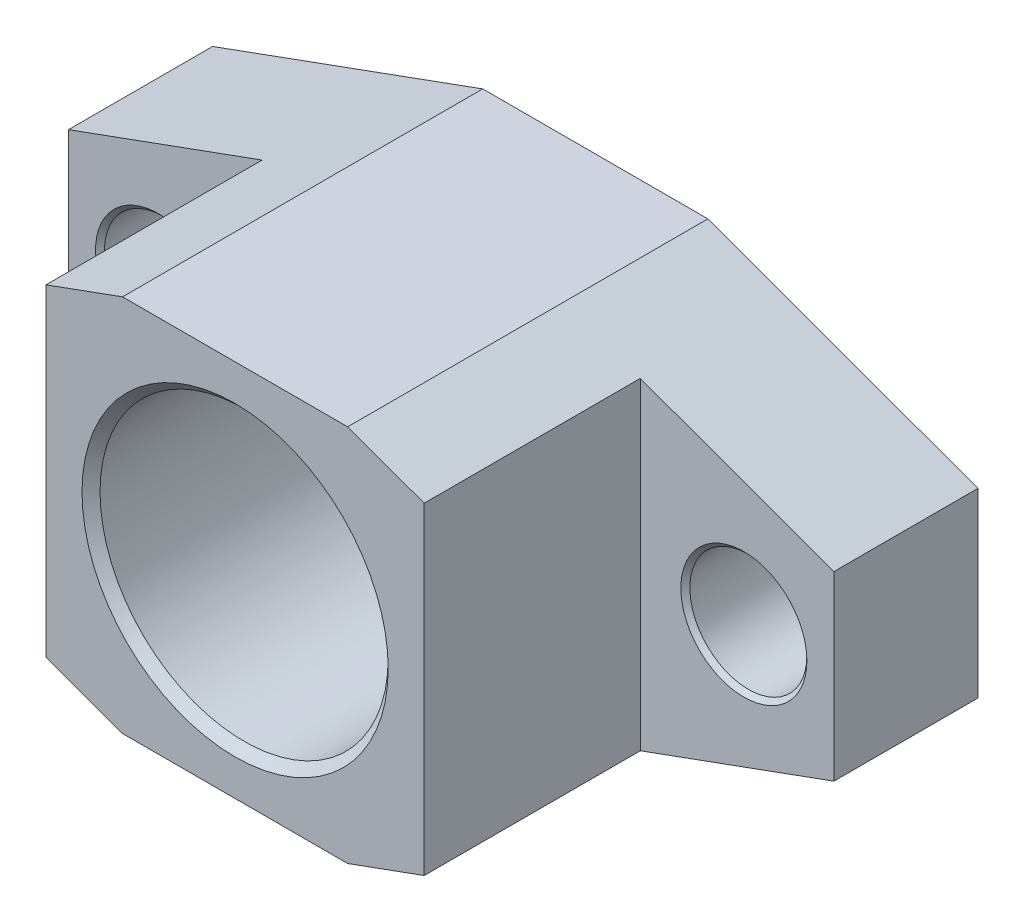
ISO-10303-21;
HEADER;
FILE_DESCRIPTION(('STEP AP214'),'2;1');
FILE_NAME('part.step','',(''),(''),'','','');
FILE_SCHEMA(('AUTOMOTIVE_DESIGN { 1 0 10303 214 1 1 1 1 }'));
ENDSEC;
DATA;
#1=APPLICATION_CONTEXT('core data for automotive mechanical design processes');
#2=APPLICATION_PROTOCOL_DEFINITION('international standard','automotive_design',2000,#1);
#3=PRODUCT_CONTEXT('',#1,'mechanical');
#4=PRODUCT('Part','Part','',(#3));
#5=PRODUCT_RELATED_PRODUCT_CATEGORY('part','',(#4));
#6=PRODUCT_DEFINITION_FORMATION('','',#4);
#7=PRODUCT_DEFINITION_CONTEXT('part definition',#1,'design');
#8=PRODUCT_DEFINITION('design','',#6,#7);
#9=PRODUCT_DEFINITION_SHAPE('','',#8);
#10=(LENGTH_UNIT() NAMED_UNIT(*) SI_UNIT(.MILLI.,.METRE.));
#11=(NAMED_UNIT(*) PLANE_ANGLE_UNIT() SI_UNIT($,.RADIAN.));
#12=(NAMED_UNIT(*) SI_UNIT($,.STERADIAN.) SOLID_ANGLE_UNIT());
#13=UNCERTAINTY_MEASURE_WITH_UNIT(LENGTH_MEASURE(1.E-05),#10,'distance_accuracy_value','');
#14=(GEOMETRIC_REPRESENTATION_CONTEXT(3) GLOBAL_UNCERTAINTY_ASSIGNED_CONTEXT((#13)) GLOBAL_UNIT_ASSIGNED_CONTEXT((#10,
#11,#12)) REPRESENTATION_CONTEXT('',''));
#15=CARTESIAN_POINT('',(0.,0.,0.));
#16=DIRECTION('',(0.,0.,1.));
#17=DIRECTION('',(1.,0.,0.));
#18=AXIS2_PLACEMENT_3D('',#15,#16,#17);
#19=CARTESIAN_POINT('',(-42.5,10.0808929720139,16.));
#20=DIRECTION('',(0.,0.,1.));
#21=DIRECTION('',(1.,0.,0.));
#22=AXIS2_PLACEMENT_3D('',#19,#20,#21);
#23=PLANE('',#22);
#24=CARTESIAN_POINT('',(32.5,0.,16.));
#25=DIRECTION('',(0.,0.,1.));
#26=DIRECTION('',(1.,0.,0.));
#27=AXIS2_PLACEMENT_3D('',#24,#25,#26);
#28=CIRCLE('',#27,7.);
#29=CARTESIAN_POINT('',(39.5,0.,16.));
#30=VERTEX_POINT('',#29);
#31=EDGE_CURVE('E486',#30,#30,#28,.T.);
#32=ORIENTED_EDGE('',*,*,#31,.F.);
#33=EDGE_LOOP('',(#32));
#34=FACE_BOUND('',#33,.T.);
#35=DIRECTION('',(0.,1.,0.));
#36=VECTOR('',#35,1.);
#37=CARTESIAN_POINT('',(21.,17.9062530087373,16.));
#38=LINE('',#37,#36);
#39=CARTESIAN_POINT('',(21.,-17.9062530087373,16.));
#40=VERTEX_POINT('',#39);
#41=CARTESIAN_POINT('',(21.,17.9062530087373,16.));
#42=VERTEX_POINT('',#41);
#43=EDGE_CURVE('E35',#40,#42,#38,.T.);
#44=ORIENTED_EDGE('',*,*,#43,.F.);
#45=DIRECTION('',(0.939692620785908,0.342020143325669,0.));
#46=VECTOR('',#45,1.);
#47=CARTESIAN_POINT('',(12.5,-21.,16.));
#48=LINE('',#47,#46);
#49=CARTESIAN_POINT('',(42.5,-10.0808929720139,16.));
#50=VERTEX_POINT('',#49);
#51=EDGE_CURVE('E161',#40,#50,#48,.T.);
#52=ORIENTED_EDGE('',*,*,#51,.T.);
#53=DIRECTION('',(0.,1.,0.));
#54=VECTOR('',#53,1.);
#55=CARTESIAN_POINT('',(42.5,10.0808929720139,16.));
#56=LINE('',#55,#54);
#57=CARTESIAN_POINT('',(42.5,10.0808929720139,16.));
#58=VERTEX_POINT('',#57);
#59=EDGE_CURVE('E167',#50,#58,#56,.T.);
#60=ORIENTED_EDGE('',*,*,#59,.T.);
#61=DIRECTION('',(-0.939692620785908,0.342020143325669,0.));
#62=VECTOR('',#61,1.);
#63=CARTESIAN_POINT('',(12.5,21.,16.));
#64=LINE('',#63,#62);
#65=EDGE_CURVE('E31',#58,#42,#64,.T.);
#66=ORIENTED_EDGE('',*,*,#65,.T.);
#67=EDGE_LOOP('',(#44,#52,#60,#66));
#68=FACE_BOUND('',#67,.T.);
#69=ADVANCED_FACE('F14',(#34,#68),#23,.T.);
#70=CARTESIAN_POINT('',(-12.5,21.,16.));
#71=DIRECTION('',(0.342020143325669,-0.939692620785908,0.));
#72=DIRECTION('',(0.939692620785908,0.342020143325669,0.));
#73=AXIS2_PLACEMENT_3D('',#70,#71,#72);
#74=PLANE('',#73);
#75=DIRECTION('',(-0.939692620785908,-0.342020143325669,0.));
#76=VECTOR('',#75,1.);
#77=CARTESIAN_POINT('',(-12.5,21.,0.));
#78=LINE('',#77,#76);
#79=CARTESIAN_POINT('',(-12.5,21.,0.));
#80=VERTEX_POINT('',#79);
#81=CARTESIAN_POINT('',(-42.5,10.0808929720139,0.));
#82=VERTEX_POINT('',#81);
#83=EDGE_CURVE('E130',#80,#82,#78,.T.);
#84=ORIENTED_EDGE('',*,*,#83,.T.);
#85=DIRECTION('',(0.,0.,-1.));
#86=VECTOR('',#85,1.);
#87=CARTESIAN_POINT('',(-42.5,10.0808929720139,16.));
#88=LINE('',#87,#86);
#89=CARTESIAN_POINT('',(-42.5,10.0808929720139,16.));
#90=VERTEX_POINT('',#89);
#91=EDGE_CURVE('E9',#90,#82,#88,.T.);
#92=ORIENTED_EDGE('',*,*,#91,.F.);
#93=DIRECTION('',(-0.939692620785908,-0.342020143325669,0.));
#94=VECTOR('',#93,1.);
#95=CARTESIAN_POINT('',(-12.5,21.,16.));
#96=LINE('',#95,#94);
#97=CARTESIAN_POINT('',(-21.,17.9062530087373,16.));
#98=VERTEX_POINT('',#97);
#99=EDGE_CURVE('E129',#98,#90,#96,.T.);
#100=ORIENTED_EDGE('',*,*,#99,.F.);
#101=DIRECTION('',(0.,0.,-1.));
#102=VECTOR('',#101,1.);
#103=CARTESIAN_POINT('',(-21.,17.9062530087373,40.));
#104=LINE('',#103,#102);
#105=CARTESIAN_POINT('',(-21.,17.9062530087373,40.));
#106=VERTEX_POINT('',#105);
#107=EDGE_CURVE('E108',#106,#98,#104,.T.);
#108=ORIENTED_EDGE('',*,*,#107,.F.);
#109=DIRECTION('',(-0.939692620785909,-0.342020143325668,0.));
#110=VECTOR('',#109,1.);
#111=CARTESIAN_POINT('',(-12.5,21.,40.));
#112=LINE('',#111,#110);
#113=CARTESIAN_POINT('',(-12.5,21.,40.));
#114=VERTEX_POINT('',#113);
#115=EDGE_CURVE('E115',#114,#106,#112,.T.);
#116=ORIENTED_EDGE('',*,*,#115,.F.);
#117=DIRECTION('',(0.,0.,-1.));
#118=VECTOR('',#117,1.);
#119=CARTESIAN_POINT('',(-12.5,21.,16.));
#120=LINE('',#119,#118);
#121=EDGE_CURVE('E172',#114,#80,#120,.T.);
#122=ORIENTED_EDGE('',*,*,#121,.T.);
#123=EDGE_LOOP('',(#84,#92,#100,#108,#116,#122));
#124=FACE_BOUND('',#123,.T.);
#125=ADVANCED_FACE('F16',(#124),#74,.F.);
#126=CARTESIAN_POINT('',(-42.5,10.0808929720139,16.));
#127=DIRECTION('',(1.,0.,0.));
#128=DIRECTION('',(0.,0.,-1.));
#129=AXIS2_PLACEMENT_3D('',#126,#127,#128);
#130=PLANE('',#129);
#131=DIRECTION('',(0.,-1.,0.));
#132=VECTOR('',#131,1.);
#133=CARTESIAN_POINT('',(-42.5,10.0808929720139,0.));
#134=LINE('',#133,#132);
#135=CARTESIAN_POINT('',(-42.5,-10.0808929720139,0.));
#136=VERTEX_POINT('',#135);
#137=EDGE_CURVE('E132',#82,#136,#134,.T.);
#138=ORIENTED_EDGE('',*,*,#137,.T.);
#139=DIRECTION('',(0.,0.,-1.));
#140=VECTOR('',#139,1.);
#141=CARTESIAN_POINT('',(-42.5,-10.0808929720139,16.));
#142=LINE('',#141,#140);
#143=CARTESIAN_POINT('',(-42.5,-10.0808929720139,16.));
#144=VERTEX_POINT('',#143);
#145=EDGE_CURVE('E23',#144,#136,#142,.T.);
#146=ORIENTED_EDGE('',*,*,#145,.F.);
#147=DIRECTION('',(0.,-1.,0.));
#148=VECTOR('',#147,1.);
#149=CARTESIAN_POINT('',(-42.5,10.0808929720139,16.));
#150=LINE('',#149,#148);
#151=EDGE_CURVE('E153',#90,#144,#150,.T.);
#152=ORIENTED_EDGE('',*,*,#151,.F.);
#153=ORIENTED_EDGE('',*,*,#91,.T.);
#154=EDGE_LOOP('',(#138,#146,#152,#153));
#155=FACE_BOUND('',#154,.T.);
#156=ADVANCED_FACE('F244',(#155),#130,.F.);
#157=CARTESIAN_POINT('',(-12.5,-21.,16.));
#158=DIRECTION('',(0.342020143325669,0.939692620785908,0.));
#159=DIRECTION('',(-0.939692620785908,0.342020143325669,0.));
#160=AXIS2_PLACEMENT_3D('',#157,#158,#159);
#161=PLANE('',#160);
#162=DIRECTION('',(0.939692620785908,-0.342020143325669,0.));
#163=VECTOR('',#162,1.);
#164=CARTESIAN_POINT('',(-12.5,-21.,0.));
#165=LINE('',#164,#163);
#166=CARTESIAN_POINT('',(-12.5,-21.,0.));
#167=VERTEX_POINT('',#166);
#168=EDGE_CURVE('E288',#136,#167,#165,.T.);
#169=ORIENTED_EDGE('',*,*,#168,.T.);
#170=DIRECTION('',(0.,0.,-1.));
#171=VECTOR('',#170,1.);
#172=CARTESIAN_POINT('',(-12.5,-21.,16.));
#173=LINE('',#172,#171);
#174=CARTESIAN_POINT('',(-12.5,-21.,40.));
#175=VERTEX_POINT('',#174);
#176=EDGE_CURVE('E268',#175,#167,#173,.T.);
#177=ORIENTED_EDGE('',*,*,#176,.F.);
#178=DIRECTION('',(0.939692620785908,-0.34202014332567,0.));
#179=VECTOR('',#178,1.);
#180=CARTESIAN_POINT('',(-21.,-17.9062530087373,40.));
#181=LINE('',#180,#179);
#182=CARTESIAN_POINT('',(-21.,-17.9062530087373,40.));
#183=VERTEX_POINT('',#182);
#184=EDGE_CURVE('E114',#183,#175,#181,.T.);
#185=ORIENTED_EDGE('',*,*,#184,.F.);
#186=DIRECTION('',(0.,0.,-1.));
#187=VECTOR('',#186,1.);
#188=CARTESIAN_POINT('',(-21.,-17.9062530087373,40.));
#189=LINE('',#188,#187);
#190=CARTESIAN_POINT('',(-21.,-17.9062530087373,16.));
#191=VERTEX_POINT('',#190);
#192=EDGE_CURVE('E110',#183,#191,#189,.T.);
#193=ORIENTED_EDGE('',*,*,#192,.T.);
#194=DIRECTION('',(0.939692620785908,-0.342020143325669,0.));
#195=VECTOR('',#194,1.);
#196=CARTESIAN_POINT('',(-12.5,-21.,16.));
#197=LINE('',#196,#195);
#198=EDGE_CURVE('E159',#144,#191,#197,.T.);
#199=ORIENTED_EDGE('',*,*,#198,.F.);
#200=ORIENTED_EDGE('',*,*,#145,.T.);
#201=EDGE_LOOP('',(#169,#177,#185,#193,#199,#200));
#202=FACE_BOUND('',#201,.T.);
#203=ADVANCED_FACE('F265',(#202),#161,.F.);
#204=CARTESIAN_POINT('',(12.5,-21.,16.));
#205=DIRECTION('',(0.,1.,0.));
#206=DIRECTION('',(-1.,0.,0.));
#207=AXIS2_PLACEMENT_3D('',#204,#205,#206);
#208=PLANE('',#207);
#209=DIRECTION('',(1.,0.,0.));
#210=VECTOR('',#209,1.);
#211=CARTESIAN_POINT('',(12.5,-21.,0.));
#212=LINE('',#211,#210);
#213=CARTESIAN_POINT('',(12.5,-21.,0.));
#214=VERTEX_POINT('',#213);
#215=EDGE_CURVE('E274',#167,#214,#212,.T.);
#216=ORIENTED_EDGE('',*,*,#215,.T.);
#217=DIRECTION('',(0.,0.,-1.));
#218=VECTOR('',#217,1.);
#219=CARTESIAN_POINT('',(12.5,-21.,16.));
#220=LINE('',#219,#218);
#221=CARTESIAN_POINT('',(12.5,-21.,40.));
#222=VERTEX_POINT('',#221);
#223=EDGE_CURVE('E273',#222,#214,#220,.T.);
#224=ORIENTED_EDGE('',*,*,#223,.F.);
#225=DIRECTION('',(1.,0.,0.));
#226=VECTOR('',#225,1.);
#227=CARTESIAN_POINT('',(-12.5,-21.,40.));
#228=LINE('',#227,#226);
#229=EDGE_CURVE('E185',#175,#222,#228,.T.);
#230=ORIENTED_EDGE('',*,*,#229,.F.);
#231=ORIENTED_EDGE('',*,*,#176,.T.);
#232=EDGE_LOOP('',(#216,#224,#230,#231));
#233=FACE_BOUND('',#232,.T.);
#234=ADVANCED_FACE('F271',(#233),#208,.F.);
#235=CARTESIAN_POINT('',(12.5,-21.,16.));
#236=DIRECTION('',(-0.342020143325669,0.939692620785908,0.));
#237=DIRECTION('',(-0.939692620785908,-0.342020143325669,0.));
#238=AXIS2_PLACEMENT_3D('',#235,#236,#237);
#239=PLANE('',#238);
#240=DIRECTION('',(0.939692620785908,0.342020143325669,0.));
#241=VECTOR('',#240,1.);
#242=CARTESIAN_POINT('',(12.5,-21.,0.));
#243=LINE('',#242,#241);
#244=CARTESIAN_POINT('',(42.5,-10.0808929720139,0.));
#245=VERTEX_POINT('',#244);
#246=EDGE_CURVE('E285',#214,#245,#243,.T.);
#247=ORIENTED_EDGE('',*,*,#246,.T.);
#248=DIRECTION('',(0.,0.,-1.));
#249=VECTOR('',#248,1.);
#250=CARTESIAN_POINT('',(42.5,-10.0808929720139,16.));
#251=LINE('',#250,#249);
#252=EDGE_CURVE('E209',#50,#245,#251,.T.);
#253=ORIENTED_EDGE('',*,*,#252,.F.);
#254=ORIENTED_EDGE('',*,*,#51,.F.);
#255=DIRECTION('',(0.,0.,-1.));
#256=VECTOR('',#255,1.);
#257=CARTESIAN_POINT('',(21.,-17.9062530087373,40.));
#258=LINE('',#257,#256);
#259=CARTESIAN_POINT('',(21.,-17.9062530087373,40.));
#260=VERTEX_POINT('',#259);
#261=EDGE_CURVE('E134',#260,#40,#258,.T.);
#262=ORIENTED_EDGE('',*,*,#261,.F.);
#263=DIRECTION('',(0.939692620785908,0.34202014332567,0.));
#264=VECTOR('',#263,1.);
#265=CARTESIAN_POINT('',(12.5,-21.,40.));
#266=LINE('',#265,#264);
#267=EDGE_CURVE('E188',#222,#260,#266,.T.);
#268=ORIENTED_EDGE('',*,*,#267,.F.);
#269=ORIENTED_EDGE('',*,*,#223,.T.);
#270=EDGE_LOOP('',(#247,#253,#254,#262,#268,#269));
#271=FACE_BOUND('',#270,.T.);
#272=ADVANCED_FACE('F205',(#271),#239,.F.);
#273=CARTESIAN_POINT('',(42.5,10.0808929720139,16.));
#274=DIRECTION('',(-1.,0.,0.));
#275=DIRECTION('',(0.,0.,1.));
#276=AXIS2_PLACEMENT_3D('',#273,#274,#275);
#277=PLANE('',#276);
#278=DIRECTION('',(0.,1.,0.));
#279=VECTOR('',#278,1.);
#280=CARTESIAN_POINT('',(42.5,10.0808929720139,0.));
#281=LINE('',#280,#279);
#282=CARTESIAN_POINT('',(42.5,10.0808929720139,0.));
#283=VERTEX_POINT('',#282);
#284=EDGE_CURVE('E217',#245,#283,#281,.T.);
#285=ORIENTED_EDGE('',*,*,#284,.T.);
#286=DIRECTION('',(0.,0.,-1.));
#287=VECTOR('',#286,1.);
#288=CARTESIAN_POINT('',(42.5,10.0808929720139,16.));
#289=LINE('',#288,#287);
#290=EDGE_CURVE('E214',#58,#283,#289,.T.);
#291=ORIENTED_EDGE('',*,*,#290,.F.);
#292=ORIENTED_EDGE('',*,*,#59,.F.);
#293=ORIENTED_EDGE('',*,*,#252,.T.);
#294=EDGE_LOOP('',(#285,#291,#292,#293));
#295=FACE_BOUND('',#294,.T.);
#296=ADVANCED_FACE('F215',(#295),#277,.F.);
#297=CARTESIAN_POINT('',(12.5,21.,16.));
#298=DIRECTION('',(-0.342020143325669,-0.939692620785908,0.));
#299=DIRECTION('',(0.939692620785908,-0.342020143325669,0.));
#300=AXIS2_PLACEMENT_3D('',#297,#298,#299);
#301=PLANE('',#300);
#302=DIRECTION('',(-0.939692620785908,0.342020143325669,0.));
#303=VECTOR('',#302,1.);
#304=CARTESIAN_POINT('',(12.5,21.,0.));
#305=LINE('',#304,#303);
#306=CARTESIAN_POINT('',(12.5,21.,0.));
#307=VERTEX_POINT('',#306);
#308=EDGE_CURVE('E222',#283,#307,#305,.T.);
#309=ORIENTED_EDGE('',*,*,#308,.T.);
#310=DIRECTION('',(0.,0.,-1.));
#311=VECTOR('',#310,1.);
#312=CARTESIAN_POINT('',(12.5,21.,16.));
#313=LINE('',#312,#311);
#314=CARTESIAN_POINT('',(12.5,21.,40.));
#315=VERTEX_POINT('',#314);
#316=EDGE_CURVE('E219',#315,#307,#313,.T.);
#317=ORIENTED_EDGE('',*,*,#316,.F.);
#318=DIRECTION('',(-0.939692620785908,0.342020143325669,0.));
#319=VECTOR('',#318,1.);
#320=CARTESIAN_POINT('',(21.,17.9062530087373,40.));
#321=LINE('',#320,#319);
#322=CARTESIAN_POINT('',(21.,17.9062530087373,40.));
#323=VERTEX_POINT('',#322);
#324=EDGE_CURVE('E192',#323,#315,#321,.T.);
#325=ORIENTED_EDGE('',*,*,#324,.F.);
#326=DIRECTION('',(0.,0.,-1.));
#327=VECTOR('',#326,1.);
#328=CARTESIAN_POINT('',(21.,17.9062530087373,40.));
#329=LINE('',#328,#327);
#330=EDGE_CURVE('E144',#323,#42,#329,.T.);
#331=ORIENTED_EDGE('',*,*,#330,.T.);
#332=ORIENTED_EDGE('',*,*,#65,.F.);
#333=ORIENTED_EDGE('',*,*,#290,.T.);
#334=EDGE_LOOP('',(#309,#317,#325,#331,#332,#333));
#335=FACE_BOUND('',#334,.T.);
#336=ADVANCED_FACE('F221',(#335),#301,.F.);
#337=CARTESIAN_POINT('',(12.5,21.,16.));
#338=DIRECTION('',(0.,-1.,0.));
#339=DIRECTION('',(1.,0.,0.));
#340=AXIS2_PLACEMENT_3D('',#337,#338,#339);
#341=PLANE('',#340);
#342=DIRECTION('',(-1.,0.,0.));
#343=VECTOR('',#342,1.);
#344=CARTESIAN_POINT('',(12.5,21.,0.));
#345=LINE('',#344,#343);
#346=EDGE_CURVE('E157',#307,#80,#345,.T.);
#347=ORIENTED_EDGE('',*,*,#346,.T.);
#348=ORIENTED_EDGE('',*,*,#121,.F.);
#349=DIRECTION('',(-1.,0.,0.));
#350=VECTOR('',#349,1.);
#351=CARTESIAN_POINT('',(12.5,21.,40.));
#352=LINE('',#351,#350);
#353=EDGE_CURVE('E122',#315,#114,#352,.T.);
#354=ORIENTED_EDGE('',*,*,#353,.F.);
#355=ORIENTED_EDGE('',*,*,#316,.T.);
#356=EDGE_LOOP('',(#347,#348,#354,#355));
#357=FACE_BOUND('',#356,.T.);
#358=ADVANCED_FACE('F225',(#357),#341,.F.);
#359=CARTESIAN_POINT('',(-32.5,0.,16.));
#360=DIRECTION('',(0.,0.,1.));
#361=DIRECTION('',(1.,0.,0.));
#362=AXIS2_PLACEMENT_3D('',#359,#360,#361);
#363=CIRCLE('',#362,7.);
#364=CARTESIAN_POINT('',(-25.5,0.,16.));
#365=VERTEX_POINT('',#364);
#366=EDGE_CURVE('E259',#365,#365,#363,.T.);
#367=ORIENTED_EDGE('',*,*,#366,.F.);
#368=EDGE_LOOP('',(#367));
#369=FACE_BOUND('',#368,.T.);
#370=DIRECTION('',(0.,-1.,0.));
#371=VECTOR('',#370,1.);
#372=CARTESIAN_POINT('',(-21.,17.9062530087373,16.));
#373=LINE('',#372,#371);
#374=EDGE_CURVE('E143',#98,#191,#373,.T.);
#375=ORIENTED_EDGE('',*,*,#374,.F.);
#376=ORIENTED_EDGE('',*,*,#99,.T.);
#377=ORIENTED_EDGE('',*,*,#151,.T.);
#378=ORIENTED_EDGE('',*,*,#198,.T.);
#379=EDGE_LOOP('',(#375,#376,#377,#378));
#380=FACE_BOUND('',#379,.T.);
#381=ADVANCED_FACE('F233',(#369,#380),#23,.T.);
#382=CARTESIAN_POINT('',(-42.5,10.0808929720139,0.));
#383=DIRECTION('',(0.,0.,1.));
#384=DIRECTION('',(1.,0.,0.));
#385=AXIS2_PLACEMENT_3D('',#382,#383,#384);
#386=PLANE('',#385);
#387=CARTESIAN_POINT('',(-32.5,0.,0.));
#388=DIRECTION('',(0.,0.,1.));
#389=DIRECTION('',(1.,0.,0.));
#390=AXIS2_PLACEMENT_3D('',#387,#388,#389);
#391=CIRCLE('',#390,7.);
#392=CARTESIAN_POINT('',(-25.5,0.,0.));
#393=VERTEX_POINT('',#392);
#394=EDGE_CURVE('E483',#393,#393,#391,.T.);
#395=ORIENTED_EDGE('',*,*,#394,.T.);
#396=EDGE_LOOP('',(#395));
#397=FACE_BOUND('',#396,.T.);
#398=CARTESIAN_POINT('',(32.5,0.,0.));
#399=DIRECTION('',(0.,0.,1.));
#400=DIRECTION('',(1.,0.,0.));
#401=AXIS2_PLACEMENT_3D('',#398,#399,#400);
#402=CIRCLE('',#401,7.);
#403=CARTESIAN_POINT('',(39.5,0.,0.));
#404=VERTEX_POINT('',#403);
#405=EDGE_CURVE('E495',#404,#404,#402,.T.);
#406=ORIENTED_EDGE('',*,*,#405,.T.);
#407=EDGE_LOOP('',(#406));
#408=FACE_BOUND('',#407,.T.);
#409=CARTESIAN_POINT('',(0.,0.,0.));
#410=DIRECTION('',(0.,0.,1.));
#411=DIRECTION('',(1.,0.,0.));
#412=AXIS2_PLACEMENT_3D('',#409,#410,#411);
#413=CIRCLE('',#412,17.);
#414=CARTESIAN_POINT('',(17.,0.,0.));
#415=VERTEX_POINT('',#414);
#416=EDGE_CURVE('E173',#415,#415,#413,.T.);
#417=ORIENTED_EDGE('',*,*,#416,.T.);
#418=EDGE_LOOP('',(#417));
#419=FACE_BOUND('',#418,.T.);
#420=ORIENTED_EDGE('',*,*,#83,.F.);
#421=ORIENTED_EDGE('',*,*,#346,.F.);
#422=ORIENTED_EDGE('',*,*,#308,.F.);
#423=ORIENTED_EDGE('',*,*,#284,.F.);
#424=ORIENTED_EDGE('',*,*,#246,.F.);
#425=ORIENTED_EDGE('',*,*,#215,.F.);
#426=ORIENTED_EDGE('',*,*,#168,.F.);
#427=ORIENTED_EDGE('',*,*,#137,.F.);
#428=EDGE_LOOP('',(#420,#421,#422,#423,#424,#425,#426,#427));
#429=FACE_BOUND('',#428,.T.);
#430=ADVANCED_FACE('F249',(#397,#408,#419,#429),#386,.F.);
#431=CARTESIAN_POINT('',(-21.,17.9062530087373,40.));
#432=DIRECTION('',(1.,0.,0.));
#433=DIRECTION('',(0.,1.,0.));
#434=AXIS2_PLACEMENT_3D('',#431,#432,#433);
#435=PLANE('',#434);
#436=ORIENTED_EDGE('',*,*,#374,.T.);
#437=ORIENTED_EDGE('',*,*,#192,.F.);
#438=DIRECTION('',(0.,-1.,0.));
#439=VECTOR('',#438,1.);
#440=CARTESIAN_POINT('',(-21.,17.9062530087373,40.));
#441=LINE('',#440,#439);
#442=EDGE_CURVE('E103',#106,#183,#441,.T.);
#443=ORIENTED_EDGE('',*,*,#442,.F.);
#444=ORIENTED_EDGE('',*,*,#107,.T.);
#445=EDGE_LOOP('',(#436,#437,#443,#444));
#446=FACE_BOUND('',#445,.T.);
#447=ADVANCED_FACE('F106',(#446),#435,.F.);
#448=CARTESIAN_POINT('',(21.,17.9062530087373,40.));
#449=DIRECTION('',(-1.,0.,0.));
#450=DIRECTION('',(0.,-1.,0.));
#451=AXIS2_PLACEMENT_3D('',#448,#449,#450);
#452=PLANE('',#451);
#453=ORIENTED_EDGE('',*,*,#43,.T.);
#454=ORIENTED_EDGE('',*,*,#330,.F.);
#455=DIRECTION('',(0.,1.,0.));
#456=VECTOR('',#455,1.);
#457=CARTESIAN_POINT('',(21.,17.9062530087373,40.));
#458=LINE('',#457,#456);
#459=EDGE_CURVE('E190',#260,#323,#458,.T.);
#460=ORIENTED_EDGE('',*,*,#459,.F.);
#461=ORIENTED_EDGE('',*,*,#261,.T.);
#462=EDGE_LOOP('',(#453,#454,#460,#461));
#463=FACE_BOUND('',#462,.T.);
#464=ADVANCED_FACE('F202',(#463),#452,.F.);
#465=CARTESIAN_POINT('',(-21.,17.9062530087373,40.));
#466=DIRECTION('',(0.,0.,1.));
#467=DIRECTION('',(1.,0.,0.));
#468=AXIS2_PLACEMENT_3D('',#465,#466,#467);
#469=PLANE('',#468);
#470=CARTESIAN_POINT('',(0.,0.,40.));
#471=DIRECTION('',(0.,0.,1.));
#472=DIRECTION('',(1.,0.,0.));
#473=AXIS2_PLACEMENT_3D('',#470,#471,#472);
#474=CIRCLE('',#473,17.);
#475=CARTESIAN_POINT('',(17.,0.,40.));
#476=VERTEX_POINT('',#475);
#477=EDGE_CURVE('E498',#476,#476,#474,.T.);
#478=ORIENTED_EDGE('',*,*,#477,.F.);
#479=EDGE_LOOP('',(#478));
#480=FACE_BOUND('',#479,.T.);
#481=ORIENTED_EDGE('',*,*,#115,.T.);
#482=ORIENTED_EDGE('',*,*,#442,.T.);
#483=ORIENTED_EDGE('',*,*,#184,.T.);
#484=ORIENTED_EDGE('',*,*,#229,.T.);
#485=ORIENTED_EDGE('',*,*,#267,.T.);
#486=ORIENTED_EDGE('',*,*,#459,.T.);
#487=ORIENTED_EDGE('',*,*,#324,.T.);
#488=ORIENTED_EDGE('',*,*,#353,.T.);
#489=EDGE_LOOP('',(#481,#482,#483,#484,#485,#486,#487,#488));
#490=FACE_BOUND('',#489,.T.);
#491=ADVANCED_FACE('F119',(#480,#490),#469,.T.);
#492=CARTESIAN_POINT('',(0.,0.,1.00000000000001));
#493=DIRECTION('',(0.,0.,-1.));
#494=DIRECTION('',(-1.,0.,0.));
#495=AXIS2_PLACEMENT_3D('',#492,#493,#494);
#496=CONICAL_SURFACE('',#495,16.,0.785398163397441);
#497=ORIENTED_EDGE('',*,*,#416,.F.);
#498=EDGE_LOOP('',(#497));
#499=FACE_BOUND('',#498,.T.);
#500=CARTESIAN_POINT('',(0.,0.,1.00000000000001));
#501=DIRECTION('',(0.,0.,1.));
#502=DIRECTION('',(1.,0.,0.));
#503=AXIS2_PLACEMENT_3D('',#500,#501,#502);
#504=CIRCLE('',#503,16.);
#505=CARTESIAN_POINT('',(16.,0.,1.00000000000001));
#506=VERTEX_POINT('',#505);
#507=EDGE_CURVE('E175',#506,#506,#504,.T.);
#508=ORIENTED_EDGE('',*,*,#507,.T.);
#509=EDGE_LOOP('',(#508));
#510=FACE_BOUND('',#509,.T.);
#511=ADVANCED_FACE('F377',(#499,#510),#496,.F.);
#512=CARTESIAN_POINT('',(0.,0.,40.));
#513=DIRECTION('',(0.,0.,1.));
#514=DIRECTION('',(1.,0.,0.));
#515=AXIS2_PLACEMENT_3D('',#512,#513,#514);
#516=CYLINDRICAL_SURFACE('',#515,16.);
#517=ORIENTED_EDGE('',*,*,#507,.F.);
#518=EDGE_LOOP('',(#517));
#519=FACE_BOUND('',#518,.T.);
#520=CARTESIAN_POINT('',(0.,0.,39.));
#521=DIRECTION('',(0.,0.,1.));
#522=DIRECTION('',(1.,0.,0.));
#523=AXIS2_PLACEMENT_3D('',#520,#521,#522);
#524=CIRCLE('',#523,16.);
#525=CARTESIAN_POINT('',(16.,0.,39.));
#526=VERTEX_POINT('',#525);
#527=EDGE_CURVE('E180',#526,#526,#524,.T.);
#528=ORIENTED_EDGE('',*,*,#527,.T.);
#529=EDGE_LOOP('',(#528));
#530=FACE_BOUND('',#529,.T.);
#531=ADVANCED_FACE('F386',(#519,#530),#516,.F.);
#532=CARTESIAN_POINT('',(0.,0.,40.));
#533=DIRECTION('',(0.,0.,1.));
#534=DIRECTION('',(1.,0.,0.));
#535=AXIS2_PLACEMENT_3D('',#532,#533,#534);
#536=CONICAL_SURFACE('',#535,17.,0.785398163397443);
#537=ORIENTED_EDGE('',*,*,#527,.F.);
#538=EDGE_LOOP('',(#537));
#539=FACE_BOUND('',#538,.T.);
#540=ORIENTED_EDGE('',*,*,#477,.T.);
#541=EDGE_LOOP('',(#540));
#542=FACE_BOUND('',#541,.T.);
#543=ADVANCED_FACE('F395',(#539,#542),#536,.F.);
#544=CARTESIAN_POINT('',(32.5,0.,0.5));
#545=DIRECTION('',(0.,0.,-1.));
#546=DIRECTION('',(-1.,0.,0.));
#547=AXIS2_PLACEMENT_3D('',#544,#545,#546);
#548=CONICAL_SURFACE('',#547,6.5,0.785398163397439);
#549=ORIENTED_EDGE('',*,*,#405,.F.);
#550=EDGE_LOOP('',(#549));
#551=FACE_BOUND('',#550,.T.);
#552=CARTESIAN_POINT('',(32.5,0.,0.5));
#553=DIRECTION('',(0.,0.,1.));
#554=DIRECTION('',(1.,0.,0.));
#555=AXIS2_PLACEMENT_3D('',#552,#553,#554);
#556=CIRCLE('',#555,6.5);
#557=CARTESIAN_POINT('',(39.,0.,0.5));
#558=VERTEX_POINT('',#557);
#559=EDGE_CURVE('E492',#558,#558,#556,.T.);
#560=ORIENTED_EDGE('',*,*,#559,.T.);
#561=EDGE_LOOP('',(#560));
#562=FACE_BOUND('',#561,.T.);
#563=ADVANCED_FACE('F404',(#551,#562),#548,.F.);
#564=CARTESIAN_POINT('',(32.5,0.,16.));
#565=DIRECTION('',(0.,0.,1.));
#566=DIRECTION('',(1.,0.,0.));
#567=AXIS2_PLACEMENT_3D('',#564,#565,#566);
#568=CYLINDRICAL_SURFACE('',#567,6.5);
#569=ORIENTED_EDGE('',*,*,#559,.F.);
#570=EDGE_LOOP('',(#569));
#571=FACE_BOUND('',#570,.T.);
#572=CARTESIAN_POINT('',(32.5,0.,15.5));
#573=DIRECTION('',(0.,0.,1.));
#574=DIRECTION('',(1.,0.,0.));
#575=AXIS2_PLACEMENT_3D('',#572,#573,#574);
#576=CIRCLE('',#575,6.5);
#577=CARTESIAN_POINT('',(39.,0.,15.5));
#578=VERTEX_POINT('',#577);
#579=EDGE_CURVE('E489',#578,#578,#576,.T.);
#580=ORIENTED_EDGE('',*,*,#579,.T.);
#581=EDGE_LOOP('',(#580));
#582=FACE_BOUND('',#581,.T.);
#583=ADVANCED_FACE('F413',(#571,#582),#568,.F.);
#584=CARTESIAN_POINT('',(32.5,0.,16.));
#585=DIRECTION('',(0.,0.,1.));
#586=DIRECTION('',(1.,0.,0.));
#587=AXIS2_PLACEMENT_3D('',#584,#585,#586);
#588=CONICAL_SURFACE('',#587,7.,0.785398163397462);
#589=ORIENTED_EDGE('',*,*,#579,.F.);
#590=EDGE_LOOP('',(#589));
#591=FACE_BOUND('',#590,.T.);
#592=ORIENTED_EDGE('',*,*,#31,.T.);
#593=EDGE_LOOP('',(#592));
#594=FACE_BOUND('',#593,.T.);
#595=ADVANCED_FACE('F422',(#591,#594),#588,.F.);
#596=CARTESIAN_POINT('',(-32.5,0.,0.5));
#597=DIRECTION('',(0.,0.,-1.));
#598=DIRECTION('',(-1.,0.,0.));
#599=AXIS2_PLACEMENT_3D('',#596,#597,#598);
#600=CONICAL_SURFACE('',#599,6.5,0.785398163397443);
#601=ORIENTED_EDGE('',*,*,#394,.F.);
#602=EDGE_LOOP('',(#601));
#603=FACE_BOUND('',#602,.T.);
#604=CARTESIAN_POINT('',(-32.5,0.,0.5));
#605=DIRECTION('',(0.,0.,1.));
#606=DIRECTION('',(1.,0.,0.));
#607=AXIS2_PLACEMENT_3D('',#604,#605,#606);
#608=CIRCLE('',#607,6.5);
#609=CARTESIAN_POINT('',(-26.,0.,0.5));
#610=VERTEX_POINT('',#609);
#611=EDGE_CURVE('E478',#610,#610,#608,.T.);
#612=ORIENTED_EDGE('',*,*,#611,.T.);
#613=EDGE_LOOP('',(#612));
#614=FACE_BOUND('',#613,.T.);
#615=ADVANCED_FACE('F431',(#603,#614),#600,.F.);
#616=CARTESIAN_POINT('',(-32.5,0.,16.));
#617=DIRECTION('',(0.,0.,1.));
#618=DIRECTION('',(1.,0.,0.));
#619=AXIS2_PLACEMENT_3D('',#616,#617,#618);
#620=CYLINDRICAL_SURFACE('',#619,6.5);
#621=ORIENTED_EDGE('',*,*,#611,.F.);
#622=EDGE_LOOP('',(#621));
#623=FACE_BOUND('',#622,.T.);
#624=CARTESIAN_POINT('',(-32.5,0.,15.5));
#625=DIRECTION('',(0.,0.,1.));
#626=DIRECTION('',(1.,0.,0.));
#627=AXIS2_PLACEMENT_3D('',#624,#625,#626);
#628=CIRCLE('',#627,6.5);
#629=CARTESIAN_POINT('',(-26.,0.,15.5));
#630=VERTEX_POINT('',#629);
#631=EDGE_CURVE('E476',#630,#630,#628,.T.);
#632=ORIENTED_EDGE('',*,*,#631,.T.);
#633=EDGE_LOOP('',(#632));
#634=FACE_BOUND('',#633,.T.);
#635=ADVANCED_FACE('F440',(#623,#634),#620,.F.);
#636=CARTESIAN_POINT('',(-32.5,0.,16.));
#637=DIRECTION('',(0.,0.,1.));
#638=DIRECTION('',(1.,0.,0.));
#639=AXIS2_PLACEMENT_3D('',#636,#637,#638);
#640=CONICAL_SURFACE('',#639,7.,0.785398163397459);
#641=ORIENTED_EDGE('',*,*,#631,.F.);
#642=EDGE_LOOP('',(#641));
#643=FACE_BOUND('',#642,.T.);
#644=ORIENTED_EDGE('',*,*,#366,.T.);
#645=EDGE_LOOP('',(#644));
#646=FACE_BOUND('',#645,.T.);
#647=ADVANCED_FACE('F449',(#643,#646),#640,.F.);
#648=CLOSED_SHELL('',(#69,#125,#156,#203,#234,#272,#296,#336,#358,#381,#430,#447,#464,#491,#511,
#531,#543,#563,#583,#595,#615,#635,#647));
#649=MANIFOLD_SOLID_BREP('B1',#648);
#650=ADVANCED_BREP_SHAPE_REPRESENTATION('',(#18,#649),#14);
#651=SHAPE_DEFINITION_REPRESENTATION(#9,#650);
ENDSEC;
END-ISO-10303-21;
